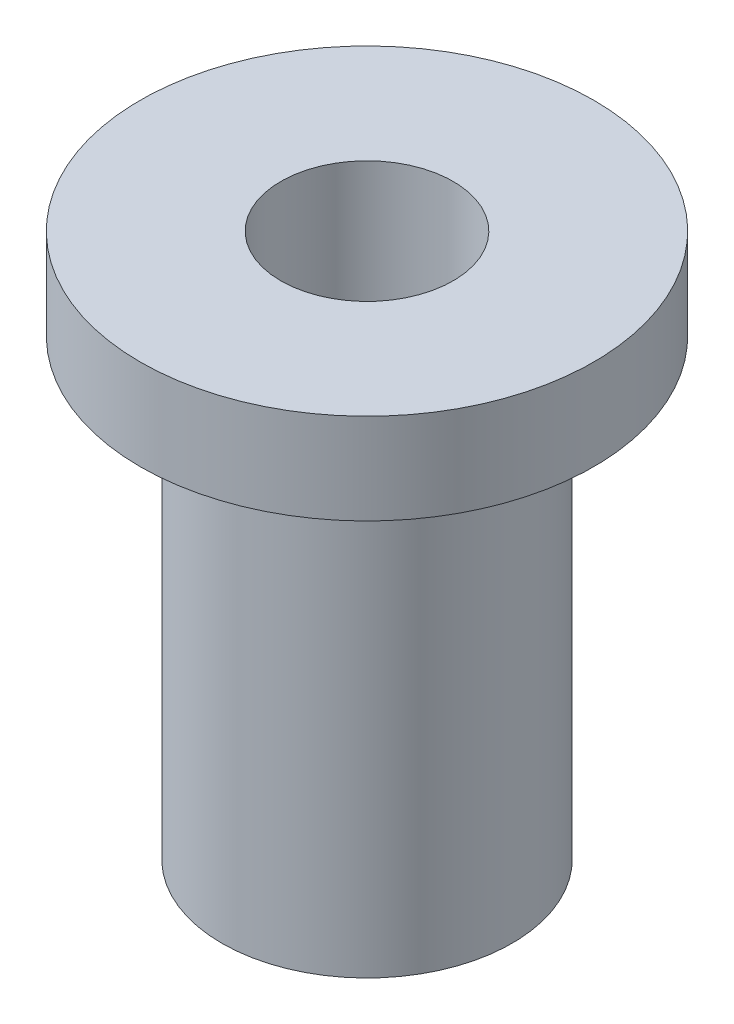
ISO-10303-21;
HEADER;
FILE_DESCRIPTION(('STEP AP214'),'2;1');
FILE_NAME('part.step','',(''),(''),'','','');
FILE_SCHEMA(('AUTOMOTIVE_DESIGN { 1 0 10303 214 1 1 1 1 }'));
ENDSEC;
DATA;
#1=APPLICATION_CONTEXT('core data for automotive mechanical design processes');
#2=APPLICATION_PROTOCOL_DEFINITION('international standard','automotive_design',2000,#1);
#3=PRODUCT_CONTEXT('',#1,'mechanical');
#4=PRODUCT('Part','Part','',(#3));
#5=PRODUCT_RELATED_PRODUCT_CATEGORY('part','',(#4));
#6=PRODUCT_DEFINITION_FORMATION('','',#4);
#7=PRODUCT_DEFINITION_CONTEXT('part definition',#1,'design');
#8=PRODUCT_DEFINITION('design','',#6,#7);
#9=PRODUCT_DEFINITION_SHAPE('','',#8);
#10=(LENGTH_UNIT() NAMED_UNIT(*) SI_UNIT(.MILLI.,.METRE.));
#11=(NAMED_UNIT(*) PLANE_ANGLE_UNIT() SI_UNIT($,.RADIAN.));
#12=(NAMED_UNIT(*) SI_UNIT($,.STERADIAN.) SOLID_ANGLE_UNIT());
#13=UNCERTAINTY_MEASURE_WITH_UNIT(LENGTH_MEASURE(1.E-05),#10,'distance_accuracy_value','');
#14=(GEOMETRIC_REPRESENTATION_CONTEXT(3) GLOBAL_UNCERTAINTY_ASSIGNED_CONTEXT((#13)) GLOBAL_UNIT_ASSIGNED_CONTEXT((#10,
#11,#12)) REPRESENTATION_CONTEXT('',''));
#15=CARTESIAN_POINT('',(0.,0.,0.));
#16=DIRECTION('',(0.,0.,1.));
#17=DIRECTION('',(1.,0.,0.));
#18=AXIS2_PLACEMENT_3D('',#15,#16,#17);
#19=CARTESIAN_POINT('',(-11.6742163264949,30.,-13.7968011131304));
#20=DIRECTION('',(0.,-1.,0.));
#21=DIRECTION('',(0.,0.,-1.));
#22=AXIS2_PLACEMENT_3D('',#19,#20,#21);
#23=CYLINDRICAL_SURFACE('',#22,12.5);
#24=CARTESIAN_POINT('',(-11.6742163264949,30.,-13.7968011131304));
#25=DIRECTION('',(0.,1.,0.));
#26=DIRECTION('',(0.,0.,1.));
#27=AXIS2_PLACEMENT_3D('',#24,#25,#26);
#28=CIRCLE('',#27,12.5);
#29=CARTESIAN_POINT('',(-11.6742163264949,30.,-1.29680111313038));
#30=VERTEX_POINT('',#29);
#31=EDGE_CURVE('E12',#30,#30,#28,.T.);
#32=ORIENTED_EDGE('',*,*,#31,.F.);
#33=EDGE_LOOP('',(#32));
#34=FACE_BOUND('',#33,.T.);
#35=CARTESIAN_POINT('',(-11.6742163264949,25.,-13.7968011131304));
#36=DIRECTION('',(0.,-1.,0.));
#37=DIRECTION('',(0.,0.,-1.));
#38=AXIS2_PLACEMENT_3D('',#35,#36,#37);
#39=CIRCLE('',#38,12.5);
#40=CARTESIAN_POINT('',(-11.6742163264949,25.,-26.2968011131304));
#41=VERTEX_POINT('',#40);
#42=EDGE_CURVE('E61',#41,#41,#39,.T.);
#43=ORIENTED_EDGE('',*,*,#42,.F.);
#44=EDGE_LOOP('',(#43));
#45=FACE_BOUND('',#44,.T.);
#46=ADVANCED_FACE('F58',(#34,#45),#23,.T.);
#47=CARTESIAN_POINT('',(-11.6742163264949,0.,-13.7968011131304));
#48=DIRECTION('',(0.,1.,0.));
#49=DIRECTION('',(0.,0.,1.));
#50=AXIS2_PLACEMENT_3D('',#47,#48,#49);
#51=PLANE('',#50);
#52=CARTESIAN_POINT('',(-11.6742163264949,0.,-13.7968011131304));
#53=DIRECTION('',(0.,1.,0.));
#54=DIRECTION('',(0.,0.,1.));
#55=AXIS2_PLACEMENT_3D('',#52,#53,#54);
#56=CIRCLE('',#55,4.75);
#57=CARTESIAN_POINT('',(-11.6742163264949,0.,-9.04680111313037));
#58=VERTEX_POINT('',#57);
#59=EDGE_CURVE('E66',#58,#58,#56,.T.);
#60=ORIENTED_EDGE('',*,*,#59,.T.);
#61=EDGE_LOOP('',(#60));
#62=FACE_BOUND('',#61,.T.);
#63=CARTESIAN_POINT('',(-11.6742163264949,0.,-13.7968011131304));
#64=DIRECTION('',(0.,-1.,0.));
#65=DIRECTION('',(0.,0.,-1.));
#66=AXIS2_PLACEMENT_3D('',#63,#64,#65);
#67=CIRCLE('',#66,8.);
#68=CARTESIAN_POINT('',(-11.6742163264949,0.,-21.7968011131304));
#69=VERTEX_POINT('',#68);
#70=EDGE_CURVE('E78',#69,#69,#67,.T.);
#71=ORIENTED_EDGE('',*,*,#70,.T.);
#72=EDGE_LOOP('',(#71));
#73=FACE_BOUND('',#72,.T.);
#74=ADVANCED_FACE('F96',(#62,#73),#51,.F.);
#75=CARTESIAN_POINT('',(-11.6742163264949,30.,-13.7968011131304));
#76=DIRECTION('',(0.,1.,0.));
#77=DIRECTION('',(0.,0.,1.));
#78=AXIS2_PLACEMENT_3D('',#75,#76,#77);
#79=PLANE('',#78);
#80=CARTESIAN_POINT('',(-11.6742163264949,30.,-13.7968011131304));
#81=DIRECTION('',(0.,1.,0.));
#82=DIRECTION('',(0.,0.,1.));
#83=AXIS2_PLACEMENT_3D('',#80,#81,#82);
#84=CIRCLE('',#83,4.75);
#85=CARTESIAN_POINT('',(-11.6742163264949,30.,-9.04680111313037));
#86=VERTEX_POINT('',#85);
#87=EDGE_CURVE('E72',#86,#86,#84,.T.);
#88=ORIENTED_EDGE('',*,*,#87,.F.);
#89=EDGE_LOOP('',(#88));
#90=FACE_BOUND('',#89,.T.);
#91=ORIENTED_EDGE('',*,*,#31,.T.);
#92=EDGE_LOOP('',(#91));
#93=FACE_BOUND('',#92,.T.);
#94=ADVANCED_FACE('F101',(#90,#93),#79,.T.);
#95=CARTESIAN_POINT('',(-11.6742163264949,0.,-13.7968011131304));
#96=DIRECTION('',(0.,1.,0.));
#97=DIRECTION('',(0.,0.,1.));
#98=AXIS2_PLACEMENT_3D('',#95,#96,#97);
#99=CYLINDRICAL_SURFACE('',#98,4.75);
#100=ORIENTED_EDGE('',*,*,#59,.F.);
#101=EDGE_LOOP('',(#100));
#102=FACE_BOUND('',#101,.T.);
#103=ORIENTED_EDGE('',*,*,#87,.T.);
#104=EDGE_LOOP('',(#103));
#105=FACE_BOUND('',#104,.T.);
#106=ADVANCED_FACE('F106',(#102,#105),#99,.F.);
#107=CARTESIAN_POINT('',(-11.6742163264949,25.,-13.7968011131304));
#108=DIRECTION('',(0.,-1.,0.));
#109=DIRECTION('',(0.,0.,-1.));
#110=AXIS2_PLACEMENT_3D('',#107,#108,#109);
#111=PLANE('',#110);
#112=CARTESIAN_POINT('',(-11.6742163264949,25.,-13.7968011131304));
#113=DIRECTION('',(0.,-1.,0.));
#114=DIRECTION('',(0.,0.,-1.));
#115=AXIS2_PLACEMENT_3D('',#112,#113,#114);
#116=CIRCLE('',#115,8.);
#117=CARTESIAN_POINT('',(-11.6742163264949,25.,-21.7968011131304));
#118=VERTEX_POINT('',#117);
#119=EDGE_CURVE('E82',#118,#118,#116,.T.);
#120=ORIENTED_EDGE('',*,*,#119,.F.);
#121=EDGE_LOOP('',(#120));
#122=FACE_BOUND('',#121,.T.);
#123=ORIENTED_EDGE('',*,*,#42,.T.);
#124=EDGE_LOOP('',(#123));
#125=FACE_BOUND('',#124,.T.);
#126=ADVANCED_FACE('F93',(#122,#125),#111,.T.);
#127=CARTESIAN_POINT('',(-11.6742163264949,25.,-13.7968011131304));
#128=DIRECTION('',(0.,-1.,0.));
#129=DIRECTION('',(0.,0.,-1.));
#130=AXIS2_PLACEMENT_3D('',#127,#128,#129);
#131=CYLINDRICAL_SURFACE('',#130,8.);
#132=ORIENTED_EDGE('',*,*,#119,.T.);
#133=EDGE_LOOP('',(#132));
#134=FACE_BOUND('',#133,.T.);
#135=ORIENTED_EDGE('',*,*,#70,.F.);
#136=EDGE_LOOP('',(#135));
#137=FACE_BOUND('',#136,.T.);
#138=ADVANCED_FACE('F116',(#134,#137),#131,.T.);
#139=CLOSED_SHELL('',(#46,#74,#94,#106,#126,#138));
#140=MANIFOLD_SOLID_BREP('B2',#139);
#141=ADVANCED_BREP_SHAPE_REPRESENTATION('',(#18,#140),#14);
#142=SHAPE_DEFINITION_REPRESENTATION(#9,#141);
ENDSEC;
END-ISO-10303-21;
